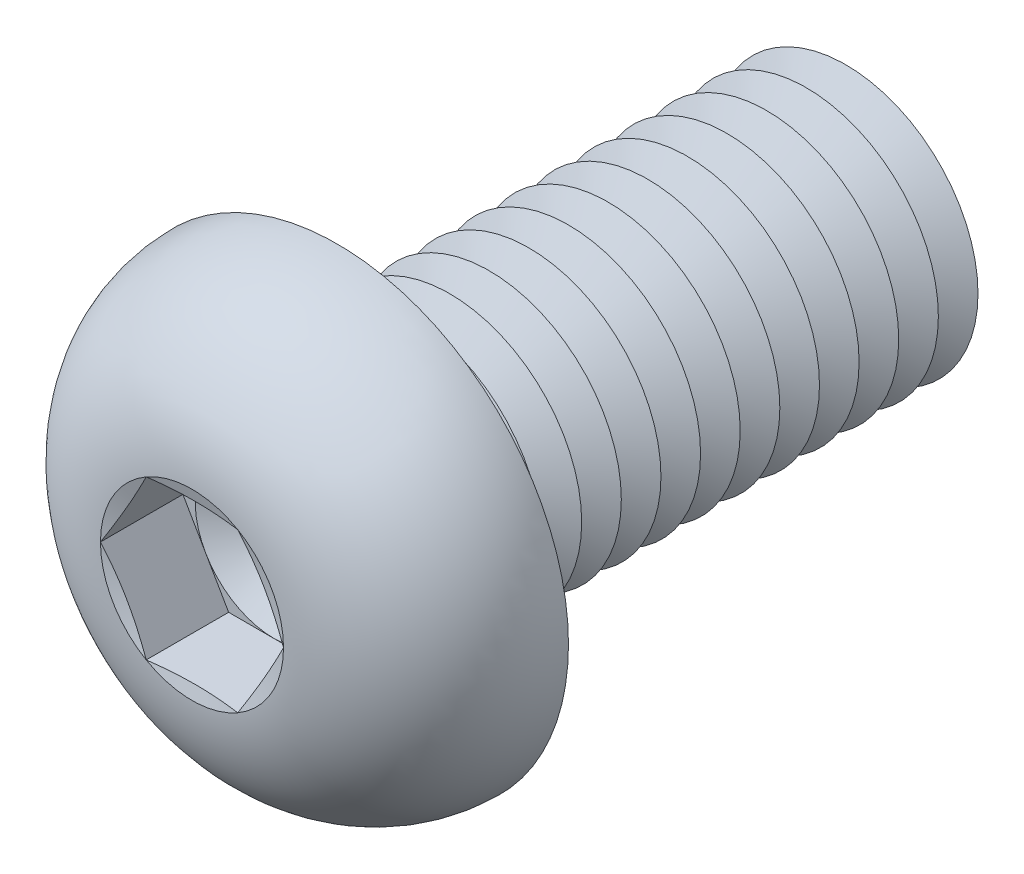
ISO-10303-21;
HEADER;
FILE_DESCRIPTION(('STEP AP214'),'2;1');
FILE_NAME('part.step','',(''),(''),'','','');
FILE_SCHEMA(('AUTOMOTIVE_DESIGN { 1 0 10303 214 1 1 1 1 }'));
ENDSEC;
DATA;
#1=APPLICATION_CONTEXT('core data for automotive mechanical design processes');
#2=APPLICATION_PROTOCOL_DEFINITION('international standard','automotive_design',2000,#1);
#3=PRODUCT_CONTEXT('',#1,'mechanical');
#4=PRODUCT('Part','Part','',(#3));
#5=PRODUCT_RELATED_PRODUCT_CATEGORY('part','',(#4));
#6=PRODUCT_DEFINITION_FORMATION('','',#4);
#7=PRODUCT_DEFINITION_CONTEXT('part definition',#1,'design');
#8=PRODUCT_DEFINITION('design','',#6,#7);
#9=PRODUCT_DEFINITION_SHAPE('','',#8);
#10=(LENGTH_UNIT() NAMED_UNIT(*) SI_UNIT(.MILLI.,.METRE.));
#11=(NAMED_UNIT(*) PLANE_ANGLE_UNIT() SI_UNIT($,.RADIAN.));
#12=(NAMED_UNIT(*) SI_UNIT($,.STERADIAN.) SOLID_ANGLE_UNIT());
#13=UNCERTAINTY_MEASURE_WITH_UNIT(LENGTH_MEASURE(1.E-05),#10,'distance_accuracy_value','');
#14=(GEOMETRIC_REPRESENTATION_CONTEXT(3) GLOBAL_UNCERTAINTY_ASSIGNED_CONTEXT((#13)) GLOBAL_UNIT_ASSIGNED_CONTEXT((#10,
#11,#12)) REPRESENTATION_CONTEXT('',''));
#15=CARTESIAN_POINT('',(0.,0.,0.));
#16=DIRECTION('',(0.,0.,1.));
#17=DIRECTION('',(1.,0.,0.));
#18=AXIS2_PLACEMENT_3D('',#15,#16,#17);
#19=CARTESIAN_POINT('',(0.,0.,2.38));
#20=DIRECTION('',(0.,0.,1.));
#21=DIRECTION('',(1.,0.,0.));
#22=AXIS2_PLACEMENT_3D('',#19,#20,#21);
#23=PLANE('',#22);
#24=CARTESIAN_POINT('',(0.,0.,2.38));
#25=DIRECTION('',(0.,0.,1.));
#26=DIRECTION('',(1.,0.,0.));
#27=AXIS2_PLACEMENT_3D('',#24,#25,#26);
#28=CIRCLE('',#27,2.99999860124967);
#29=CARTESIAN_POINT('',(2.598075,1.49999930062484,2.38));
#30=VERTEX_POINT('',#29);
#31=CARTESIAN_POINT('',(0.,2.99999860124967,2.38));
#32=VERTEX_POINT('',#31);
#33=EDGE_CURVE('E118',#30,#32,#28,.T.);
#34=ORIENTED_EDGE('',*,*,#33,.F.);
#35=DIRECTION('',(-0.500000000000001,0.866025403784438,0.));
#36=VECTOR('',#35,1.);
#37=CARTESIAN_POINT('',(3.4641,0.,2.38));
#38=LINE('',#37,#36);
#39=CARTESIAN_POINT('',(1.73205,2.99999860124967,2.38));
#40=VERTEX_POINT('',#39);
#41=EDGE_CURVE('E125',#30,#40,#38,.T.);
#42=ORIENTED_EDGE('',*,*,#41,.T.);
#43=DIRECTION('',(-1.,0.,0.));
#44=VECTOR('',#43,1.);
#45=CARTESIAN_POINT('',(1.73205,2.99999860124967,2.38));
#46=LINE('',#45,#44);
#47=EDGE_CURVE('E136',#40,#32,#46,.T.);
#48=ORIENTED_EDGE('',*,*,#47,.T.);
#49=EDGE_LOOP('',(#34,#42,#48));
#50=FACE_BOUND('',#49,.T.);
#51=ADVANCED_FACE('F39',(#50),#23,.T.);
#52=CARTESIAN_POINT('',(0.,0.,2.38));
#53=DIRECTION('',(0.,0.,1.));
#54=DIRECTION('',(1.,0.,0.));
#55=AXIS2_PLACEMENT_3D('',#52,#53,#54);
#56=CIRCLE('',#55,2.99999860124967);
#57=CARTESIAN_POINT('',(-2.598075,1.49999930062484,2.38));
#58=VERTEX_POINT('',#57);
#59=EDGE_CURVE('E11',#32,#58,#56,.T.);
#60=ORIENTED_EDGE('',*,*,#59,.F.);
#61=CARTESIAN_POINT('',(-1.73205,2.99999860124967,2.38));
#62=VERTEX_POINT('',#61);
#63=EDGE_CURVE('E131',#32,#62,#46,.T.);
#64=ORIENTED_EDGE('',*,*,#63,.T.);
#65=DIRECTION('',(-0.5,-0.866025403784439,0.));
#66=VECTOR('',#65,1.);
#67=CARTESIAN_POINT('',(-1.73205,2.99999860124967,2.38));
#68=LINE('',#67,#66);
#69=EDGE_CURVE('E134',#62,#58,#68,.T.);
#70=ORIENTED_EDGE('',*,*,#69,.T.);
#71=EDGE_LOOP('',(#60,#64,#70));
#72=FACE_BOUND('',#71,.T.);
#73=ADVANCED_FACE('F130',(#72),#23,.T.);
#74=CARTESIAN_POINT('',(-2.598075,-1.49999930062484,2.38));
#75=VERTEX_POINT('',#74);
#76=EDGE_CURVE('E49',#58,#75,#56,.T.);
#77=ORIENTED_EDGE('',*,*,#76,.F.);
#78=CARTESIAN_POINT('',(-3.4641,0.,2.38));
#79=VERTEX_POINT('',#78);
#80=EDGE_CURVE('E143',#58,#79,#68,.T.);
#81=ORIENTED_EDGE('',*,*,#80,.T.);
#82=DIRECTION('',(0.5,-0.866025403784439,0.));
#83=VECTOR('',#82,1.);
#84=CARTESIAN_POINT('',(-3.4641,0.,2.38));
#85=LINE('',#84,#83);
#86=EDGE_CURVE('E152',#79,#75,#85,.T.);
#87=ORIENTED_EDGE('',*,*,#86,.T.);
#88=EDGE_LOOP('',(#77,#81,#87));
#89=FACE_BOUND('',#88,.T.);
#90=ADVANCED_FACE('F500',(#89),#23,.T.);
#91=CARTESIAN_POINT('',(0.,-2.99999860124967,2.38));
#92=VERTEX_POINT('',#91);
#93=EDGE_CURVE('E463',#75,#92,#56,.T.);
#94=ORIENTED_EDGE('',*,*,#93,.F.);
#95=CARTESIAN_POINT('',(-1.73205,-2.99999860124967,2.38));
#96=VERTEX_POINT('',#95);
#97=EDGE_CURVE('E151',#75,#96,#85,.T.);
#98=ORIENTED_EDGE('',*,*,#97,.T.);
#99=DIRECTION('',(1.,0.,0.));
#100=VECTOR('',#99,1.);
#101=CARTESIAN_POINT('',(-1.73205,-2.99999860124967,2.38));
#102=LINE('',#101,#100);
#103=EDGE_CURVE('E157',#96,#92,#102,.T.);
#104=ORIENTED_EDGE('',*,*,#103,.T.);
#105=EDGE_LOOP('',(#94,#98,#104));
#106=FACE_BOUND('',#105,.T.);
#107=ADVANCED_FACE('F505',(#106),#23,.T.);
#108=CARTESIAN_POINT('',(2.598075,-1.49999930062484,2.38));
#109=VERTEX_POINT('',#108);
#110=EDGE_CURVE('E56',#92,#109,#56,.T.);
#111=ORIENTED_EDGE('',*,*,#110,.F.);
#112=CARTESIAN_POINT('',(1.73205,-2.99999860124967,2.38));
#113=VERTEX_POINT('',#112);
#114=EDGE_CURVE('E156',#92,#113,#102,.T.);
#115=ORIENTED_EDGE('',*,*,#114,.T.);
#116=DIRECTION('',(0.5,0.866025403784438,0.));
#117=VECTOR('',#116,1.);
#118=CARTESIAN_POINT('',(1.73205,-2.99999860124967,2.38));
#119=LINE('',#118,#117);
#120=EDGE_CURVE('E162',#113,#109,#119,.T.);
#121=ORIENTED_EDGE('',*,*,#120,.T.);
#122=EDGE_LOOP('',(#111,#115,#121));
#123=FACE_BOUND('',#122,.T.);
#124=ADVANCED_FACE('F358',(#123),#23,.T.);
#125=CARTESIAN_POINT('',(0.,0.,5.5));
#126=DIRECTION('',(0.,0.,1.));
#127=DIRECTION('',(1.,0.,0.));
#128=AXIS2_PLACEMENT_3D('',#125,#126,#127);
#129=CONICAL_SURFACE('',#128,3.4641,1.30899693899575);
#130=CARTESIAN_POINT('',(3.46421547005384,-0.000199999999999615,5.50003094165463));
#131=CARTESIAN_POINT('',(3.39227822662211,0.124398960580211,5.48074619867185));
#132=CARTESIAN_POINT('',(3.32021054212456,0.24922385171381,5.46323875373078));
#133=CARTESIAN_POINT('',(3.17582062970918,0.49931451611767,5.43247971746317));
#134=CARTESIAN_POINT('',(3.10349831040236,0.62458044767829,5.41922985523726));
#135=CARTESIAN_POINT('',(2.95903767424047,0.874793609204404,5.39775958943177));
#136=CARTESIAN_POINT('',(2.88690033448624,0.999739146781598,5.38951357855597));
#137=CARTESIAN_POINT('',(2.74253364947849,1.24978958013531,5.37845651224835));
#138=CARTESIAN_POINT('',(2.67030432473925,1.37489444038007,5.3756444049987));
#139=CARTESIAN_POINT('',(2.52584567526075,1.6251041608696,5.3756444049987));
#140=CARTESIAN_POINT('',(2.45361635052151,1.75020902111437,5.37845651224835));
#141=CARTESIAN_POINT('',(2.30924966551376,2.00025945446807,5.38951357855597));
#142=CARTESIAN_POINT('',(2.23711232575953,2.12520499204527,5.39775958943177));
#143=CARTESIAN_POINT('',(2.09265168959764,2.37541815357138,5.41922985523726));
#144=CARTESIAN_POINT('',(2.02032937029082,2.500684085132,5.43247971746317));
#145=CARTESIAN_POINT('',(1.87593945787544,2.75077474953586,5.46323875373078));
#146=CARTESIAN_POINT('',(1.80387177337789,2.87559964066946,5.48074619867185));
#147=CARTESIAN_POINT('',(1.73193452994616,3.00019860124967,5.50003094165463));
#148=B_SPLINE_CURVE_WITH_KNOTS('',3,(#130,#131,#132,#133,#134,#135,#136,#137,#138,#139,#140,
#141,#142,#143,#144,#145,#146,#147),.UNSPECIFIED.,.F.,.F.,(4,2,2,2,2,2,2,2,4),(0.,
0.435506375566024,0.871189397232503,1.3046235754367,1.7379738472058,2.1713241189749,
2.6047582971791,3.04044131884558,3.4759476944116),.UNSPECIFIED.);
#149=CARTESIAN_POINT('',(3.4641,0.,5.5));
#150=VERTEX_POINT('',#149);
#151=CARTESIAN_POINT('',(1.73204999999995,2.9999986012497,5.5));
#152=VERTEX_POINT('',#151);
#153=EDGE_CURVE('E229',#150,#152,#148,.T.);
#154=ORIENTED_EDGE('',*,*,#153,.F.);
#155=CARTESIAN_POINT('',(0.,0.,5.5));
#156=DIRECTION('',(0.,0.,-1.));
#157=DIRECTION('',(-1.,0.,0.));
#158=AXIS2_PLACEMENT_3D('',#155,#156,#157);
#159=CIRCLE('',#158,3.4641);
#160=EDGE_CURVE('E310',#152,#150,#159,.T.);
#161=ORIENTED_EDGE('',*,*,#160,.F.);
#162=EDGE_LOOP('',(#154,#161));
#163=FACE_BOUND('',#162,.T.);
#164=ADVANCED_FACE('F352',(#163),#129,.F.);
#165=CARTESIAN_POINT('',(1.73193452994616,-3.00019860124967,5.50003094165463));
#166=CARTESIAN_POINT('',(1.80387177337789,-2.87559964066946,5.48074619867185));
#167=CARTESIAN_POINT('',(1.87593945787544,-2.75077474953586,5.46323875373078));
#168=CARTESIAN_POINT('',(2.02032937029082,-2.500684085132,5.43247971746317));
#169=CARTESIAN_POINT('',(2.09265168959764,-2.37541815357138,5.41922985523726));
#170=CARTESIAN_POINT('',(2.23711232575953,-2.12520499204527,5.39775958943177));
#171=CARTESIAN_POINT('',(2.30924966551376,-2.00025945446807,5.38951357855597));
#172=CARTESIAN_POINT('',(2.45361635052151,-1.75020902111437,5.37845651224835));
#173=CARTESIAN_POINT('',(2.52584567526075,-1.6251041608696,5.3756444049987));
#174=CARTESIAN_POINT('',(2.67030432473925,-1.37489444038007,5.3756444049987));
#175=CARTESIAN_POINT('',(2.74253364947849,-1.24978958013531,5.37845651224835));
#176=CARTESIAN_POINT('',(2.88690033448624,-0.999739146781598,5.38951357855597));
#177=CARTESIAN_POINT('',(2.95903767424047,-0.874793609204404,5.39775958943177));
#178=CARTESIAN_POINT('',(3.10349831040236,-0.624580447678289,5.41922985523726));
#179=CARTESIAN_POINT('',(3.17582062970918,-0.499314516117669,5.43247971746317));
#180=CARTESIAN_POINT('',(3.32021054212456,-0.249223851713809,5.46323875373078));
#181=CARTESIAN_POINT('',(3.39227822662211,-0.124398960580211,5.48074619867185));
#182=CARTESIAN_POINT('',(3.46421547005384,0.000200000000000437,5.50003094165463));
#183=B_SPLINE_CURVE_WITH_KNOTS('',3,(#165,#166,#167,#168,#169,#170,#171,#172,#173,#174,#175,
#176,#177,#178,#179,#180,#181,#182),.UNSPECIFIED.,.F.,.F.,(4,2,2,2,2,2,2,2,4),(0.,
0.435506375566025,0.871189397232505,1.3046235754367,1.7379738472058,2.1713241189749,
2.6047582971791,3.04044131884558,3.4759476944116),.UNSPECIFIED.);
#184=CARTESIAN_POINT('',(1.73205,-2.99999860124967,5.5));
#185=VERTEX_POINT('',#184);
#186=EDGE_CURVE('E232',#185,#150,#183,.T.);
#187=ORIENTED_EDGE('',*,*,#186,.F.);
#188=EDGE_CURVE('E292',#150,#185,#159,.T.);
#189=ORIENTED_EDGE('',*,*,#188,.F.);
#190=EDGE_LOOP('',(#187,#189));
#191=FACE_BOUND('',#190,.T.);
#192=ADVANCED_FACE('F290',(#191),#129,.F.);
#193=CARTESIAN_POINT('',(-5.2273006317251,-2.99999860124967,6.18672552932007));
#194=CARTESIAN_POINT('',(-5.10075887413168,-2.99999860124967,6.15732018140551));
#195=CARTESIAN_POINT('',(-4.97415993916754,-2.99999860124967,6.12816064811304));
#196=CARTESIAN_POINT('',(-4.72082394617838,-2.99999860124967,6.07043857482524));
#197=CARTESIAN_POINT('',(-4.59408688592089,-2.99999860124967,6.04187604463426));
#198=CARTESIAN_POINT('',(-4.21358997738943,-2.99999860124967,5.95723252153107));
#199=CARTESIAN_POINT('',(-3.95959339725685,-2.99999860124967,5.90220706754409));
#200=CARTESIAN_POINT('',(-3.44835573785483,-2.99999860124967,5.79574115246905));
#201=CARTESIAN_POINT('',(-3.19110656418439,-2.99999860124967,5.74433913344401));
#202=CARTESIAN_POINT('',(-2.67540790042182,-2.99999860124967,5.6477299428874));
#203=CARTESIAN_POINT('',(-2.41695830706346,-2.99999860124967,5.60252331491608));
#204=CARTESIAN_POINT('',(-1.9055512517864,-2.99999860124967,5.52251897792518));
#205=CARTESIAN_POINT('',(-1.65263426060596,-2.99999860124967,5.48747285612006));
#206=CARTESIAN_POINT('',(-1.27220564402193,-2.99999860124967,5.44439602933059));
#207=CARTESIAN_POINT('',(-1.1452320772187,-2.99999860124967,5.43161987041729));
#208=CARTESIAN_POINT('',(-0.890973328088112,-2.99999860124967,5.40972605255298));
#209=CARTESIAN_POINT('',(-0.76368816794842,-2.99999860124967,5.40060814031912));
#210=CARTESIAN_POINT('',(-0.50944206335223,-2.99999860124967,5.38647457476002));
#211=CARTESIAN_POINT('',(-0.382482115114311,-2.99999860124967,5.38144125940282));
#212=CARTESIAN_POINT('',(-0.128463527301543,-2.99999860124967,5.37566637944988));
#213=CARTESIAN_POINT('',(-0.00140488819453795,-2.99999860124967,5.37492479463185));
#214=CARTESIAN_POINT('',(0.252672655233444,-2.99999860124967,5.37777315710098));
#215=CARTESIAN_POINT('',(0.379691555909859,-2.99999860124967,5.38136342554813));
#216=CARTESIAN_POINT('',(0.633540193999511,-2.99999860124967,5.39268816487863));
#217=CARTESIAN_POINT('',(0.760369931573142,-2.99999860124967,5.40042263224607));
#218=CARTESIAN_POINT('',(1.06836981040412,-2.99999860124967,5.42382465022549));
#219=CARTESIAN_POINT('',(1.24938929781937,-2.99999860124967,5.44147485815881));
#220=CARTESIAN_POINT('',(1.61066786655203,-2.99999860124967,5.48312309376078));
#221=CARTESIAN_POINT('',(1.7909269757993,-2.99999860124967,5.50712088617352));
#222=CARTESIAN_POINT('',(2.15127612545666,-2.99999860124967,5.56013471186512));
#223=CARTESIAN_POINT('',(2.33136383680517,-2.99999860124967,5.58916634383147));
#224=CARTESIAN_POINT('',(2.690892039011,-2.99999860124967,5.65100028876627));
#225=CARTESIAN_POINT('',(2.87033249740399,-2.99999860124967,5.68380278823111));
#226=CARTESIAN_POINT('',(3.23235399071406,-2.99999860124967,5.75295369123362));
#227=CARTESIAN_POINT('',(3.4149236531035,-2.99999860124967,5.78936117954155));
#228=CARTESIAN_POINT('',(3.77960351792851,-2.99999860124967,5.864406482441));
#229=CARTESIAN_POINT('',(3.96171371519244,-2.99999860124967,5.903044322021));
#230=CARTESIAN_POINT('',(4.32457472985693,-2.99999860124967,5.9817966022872));
#231=CARTESIAN_POINT('',(4.5053275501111,-2.99999860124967,6.02190185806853));
#232=CARTESIAN_POINT('',(4.86652484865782,-2.99999860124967,6.10342152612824));
#233=CARTESIAN_POINT('',(5.04696934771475,-2.99999860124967,6.14483584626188));
#234=CARTESIAN_POINT('',(5.2273006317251,-2.99999860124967,6.18672552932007));
#235=B_SPLINE_CURVE_WITH_KNOTS('',3,(#193,#194,#195,#196,#197,#198,#199,#200,#201,#202,#203,
#204,#205,#206,#207,#208,#209,#210,#211,#212,#213,#214,#215,#216,#217,#218,#219,#220,#221,#222,
#223,#224,#225,#226,#227,#228,#229,#230,#231,#232,#233,#234),.UNSPECIFIED.,.F.,.F.,(4,2,2,2,2,2,
2,2,2,2,2,2,2,2,2,2,2,2,2,2,4),(0.,0.389739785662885,0.779485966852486,1.5591292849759,
2.34608117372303,3.13310206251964,3.8988410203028,4.28164148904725,4.66441544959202,
5.04552531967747,5.42663339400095,5.80776972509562,6.18890573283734,6.73438998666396,
7.27985402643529,7.8270395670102,8.37425218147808,8.93272720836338,9.49120849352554,
10.0466490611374,10.6020506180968),.UNSPECIFIED.);
#236=CARTESIAN_POINT('',(-1.73205,-2.99999860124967,5.5));
#237=VERTEX_POINT('',#236);
#238=EDGE_CURVE('E242',#237,#185,#235,.T.);
#239=ORIENTED_EDGE('',*,*,#238,.F.);
#240=EDGE_CURVE('E297',#185,#237,#159,.T.);
#241=ORIENTED_EDGE('',*,*,#240,.F.);
#242=EDGE_LOOP('',(#239,#241));
#243=FACE_BOUND('',#242,.T.);
#244=ADVANCED_FACE('F298',(#243),#129,.F.);
#245=CARTESIAN_POINT('',(-3.46421547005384,0.000200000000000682,5.50003094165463));
#246=CARTESIAN_POINT('',(-3.39227822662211,-0.12439896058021,5.48074619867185));
#247=CARTESIAN_POINT('',(-3.32021054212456,-0.249223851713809,5.46323875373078));
#248=CARTESIAN_POINT('',(-3.17582062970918,-0.499314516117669,5.43247971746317));
#249=CARTESIAN_POINT('',(-3.10349831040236,-0.624580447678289,5.41922985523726));
#250=CARTESIAN_POINT('',(-2.95903767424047,-0.874793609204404,5.39775958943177));
#251=CARTESIAN_POINT('',(-2.88690033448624,-0.999739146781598,5.38951357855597));
#252=CARTESIAN_POINT('',(-2.74253364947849,-1.24978958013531,5.37845651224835));
#253=CARTESIAN_POINT('',(-2.67030432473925,-1.37489444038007,5.3756444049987));
#254=CARTESIAN_POINT('',(-2.52584567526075,-1.6251041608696,5.3756444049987));
#255=CARTESIAN_POINT('',(-2.45361635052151,-1.75020902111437,5.37845651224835));
#256=CARTESIAN_POINT('',(-2.30924966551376,-2.00025945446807,5.38951357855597));
#257=CARTESIAN_POINT('',(-2.23711232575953,-2.12520499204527,5.39775958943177));
#258=CARTESIAN_POINT('',(-2.09265168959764,-2.37541815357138,5.41922985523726));
#259=CARTESIAN_POINT('',(-2.02032937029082,-2.500684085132,5.43247971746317));
#260=CARTESIAN_POINT('',(-1.87593945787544,-2.75077474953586,5.46323875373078));
#261=CARTESIAN_POINT('',(-1.80387177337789,-2.87559964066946,5.48074619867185));
#262=CARTESIAN_POINT('',(-1.73193452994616,-3.00019860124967,5.50003094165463));
#263=B_SPLINE_CURVE_WITH_KNOTS('',3,(#245,#246,#247,#248,#249,#250,#251,#252,#253,#254,#255,
#256,#257,#258,#259,#260,#261,#262),.UNSPECIFIED.,.F.,.F.,(4,2,2,2,2,2,2,2,4),(0.,
0.435506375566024,0.871189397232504,1.3046235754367,1.7379738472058,2.1713241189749,
2.6047582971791,3.04044131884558,3.4759476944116),.UNSPECIFIED.);
#264=CARTESIAN_POINT('',(-3.4641,0.,5.5));
#265=VERTEX_POINT('',#264);
#266=EDGE_CURVE('E237',#265,#237,#263,.T.);
#267=ORIENTED_EDGE('',*,*,#266,.F.);
#268=EDGE_CURVE('E303',#237,#265,#159,.T.);
#269=ORIENTED_EDGE('',*,*,#268,.F.);
#270=EDGE_LOOP('',(#267,#269));
#271=FACE_BOUND('',#270,.T.);
#272=ADVANCED_FACE('F524',(#271),#129,.F.);
#273=CARTESIAN_POINT('',(-1.73193452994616,3.00019860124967,5.50003094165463));
#274=CARTESIAN_POINT('',(-1.8038717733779,2.87559964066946,5.48074619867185));
#275=CARTESIAN_POINT('',(-1.87593945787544,2.75077474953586,5.46323875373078));
#276=CARTESIAN_POINT('',(-2.02032937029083,2.500684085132,5.43247971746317));
#277=CARTESIAN_POINT('',(-2.09265168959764,2.37541815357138,5.41922985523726));
#278=CARTESIAN_POINT('',(-2.23711232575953,2.12520499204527,5.39775958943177));
#279=CARTESIAN_POINT('',(-2.30924966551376,2.00025945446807,5.38951357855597));
#280=CARTESIAN_POINT('',(-2.45361635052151,1.75020902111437,5.37845651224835));
#281=CARTESIAN_POINT('',(-2.52584567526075,1.6251041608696,5.3756444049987));
#282=CARTESIAN_POINT('',(-2.67030432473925,1.37489444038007,5.3756444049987));
#283=CARTESIAN_POINT('',(-2.74253364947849,1.24978958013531,5.37845651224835));
#284=CARTESIAN_POINT('',(-2.88690033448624,0.999739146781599,5.38951357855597));
#285=CARTESIAN_POINT('',(-2.95903767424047,0.874793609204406,5.39775958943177));
#286=CARTESIAN_POINT('',(-3.10349831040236,0.624580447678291,5.41922985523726));
#287=CARTESIAN_POINT('',(-3.17582062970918,0.499314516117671,5.43247971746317));
#288=CARTESIAN_POINT('',(-3.32021054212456,0.249223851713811,5.46323875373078));
#289=CARTESIAN_POINT('',(-3.39227822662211,0.124398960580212,5.48074619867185));
#290=CARTESIAN_POINT('',(-3.46421547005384,-0.000199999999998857,5.50003094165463));
#291=B_SPLINE_CURVE_WITH_KNOTS('',3,(#273,#274,#275,#276,#277,#278,#279,#280,#281,#282,#283,
#284,#285,#286,#287,#288,#289,#290),.UNSPECIFIED.,.F.,.F.,(4,2,2,2,2,2,2,2,4),(0.,
0.435506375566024,0.871189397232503,1.3046235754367,1.7379738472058,2.1713241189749,
2.6047582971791,3.04044131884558,3.4759476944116),.UNSPECIFIED.);
#292=CARTESIAN_POINT('',(-1.73205,2.99999860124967,5.5));
#293=VERTEX_POINT('',#292);
#294=EDGE_CURVE('E234',#293,#265,#291,.T.);
#295=ORIENTED_EDGE('',*,*,#294,.F.);
#296=EDGE_CURVE('E334',#265,#293,#159,.T.);
#297=ORIENTED_EDGE('',*,*,#296,.F.);
#298=EDGE_LOOP('',(#295,#297));
#299=FACE_BOUND('',#298,.T.);
#300=ADVANCED_FACE('F527',(#299),#129,.F.);
#301=CARTESIAN_POINT('',(0.,0.,-14.75));
#302=DIRECTION('',(0.,0.,1.));
#303=DIRECTION('',(1.,0.,0.));
#304=AXIS2_PLACEMENT_3D('',#301,#302,#303);
#305=CONICAL_SURFACE('',#304,5.00000000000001,1.0471975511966);
#306=CARTESIAN_POINT('',(0.,0.,-15.5));
#307=DIRECTION('',(0.,0.,1.));
#308=DIRECTION('',(1.,0.,0.));
#309=AXIS2_PLACEMENT_3D('',#306,#307,#308);
#310=CIRCLE('',#309,3.70096189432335);
#311=CARTESIAN_POINT('',(3.70096189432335,0.,-15.5));
#312=VERTEX_POINT('',#311);
#313=EDGE_CURVE('E432',#312,#312,#310,.T.);
#314=ORIENTED_EDGE('',*,*,#313,.T.);
#315=EDGE_LOOP('',(#314));
#316=FACE_BOUND('',#315,.T.);
#317=CARTESIAN_POINT('',(0.,0.,-14.75));
#318=DIRECTION('',(0.,0.,1.));
#319=DIRECTION('',(1.,0.,0.));
#320=AXIS2_PLACEMENT_3D('',#317,#318,#319);
#321=CIRCLE('',#320,5.00000000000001);
#322=CARTESIAN_POINT('',(5.00000000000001,0.,-14.75));
#323=VERTEX_POINT('',#322);
#324=EDGE_CURVE('E429',#323,#323,#321,.T.);
#325=ORIENTED_EDGE('',*,*,#324,.F.);
#326=EDGE_LOOP('',(#325));
#327=FACE_BOUND('',#326,.T.);
#328=ADVANCED_FACE('F532',(#316,#327),#305,.T.);
#329=CARTESIAN_POINT('',(0.,0.,-15.5));
#330=DIRECTION('',(0.,0.,-1.));
#331=DIRECTION('',(-1.,0.,0.));
#332=AXIS2_PLACEMENT_3D('',#329,#330,#331);
#333=CONICAL_SURFACE('',#332,3.70096189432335,1.0471975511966);
#334=CARTESIAN_POINT('',(0.,0.,-16.25));
#335=DIRECTION('',(0.,0.,1.));
#336=DIRECTION('',(1.,0.,0.));
#337=AXIS2_PLACEMENT_3D('',#334,#335,#336);
#338=CIRCLE('',#337,5.00000000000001);
#339=CARTESIAN_POINT('',(5.00000000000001,0.,-16.25));
#340=VERTEX_POINT('',#339);
#341=EDGE_CURVE('E436',#340,#340,#338,.T.);
#342=ORIENTED_EDGE('',*,*,#341,.T.);
#343=EDGE_LOOP('',(#342));
#344=FACE_BOUND('',#343,.T.);
#345=ORIENTED_EDGE('',*,*,#313,.F.);
#346=EDGE_LOOP('',(#345));
#347=FACE_BOUND('',#346,.T.);
#348=ADVANCED_FACE('F882',(#344,#347),#333,.T.);
#349=CARTESIAN_POINT('',(0.,5.00000000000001,-20.));
#350=DIRECTION('',(0.,0.,-1.));
#351=DIRECTION('',(-1.,0.,0.));
#352=AXIS2_PLACEMENT_3D('',#349,#350,#351);
#353=PLANE('',#352);
#354=CARTESIAN_POINT('',(0.,0.,-20.));
#355=DIRECTION('',(0.,0.,1.));
#356=DIRECTION('',(1.,0.,0.));
#357=AXIS2_PLACEMENT_3D('',#354,#355,#356);
#358=CIRCLE('',#357,3.70096189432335);
#359=CARTESIAN_POINT('',(3.70096189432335,0.,-20.));
#360=VERTEX_POINT('',#359);
#361=EDGE_CURVE('E324',#360,#360,#358,.T.);
#362=ORIENTED_EDGE('',*,*,#361,.F.);
#363=EDGE_LOOP('',(#362));
#364=FACE_BOUND('',#363,.T.);
#365=ADVANCED_FACE('F874',(#364),#353,.T.);
#366=CARTESIAN_POINT('',(0.,0.,-19.25));
#367=DIRECTION('',(0.,0.,1.));
#368=DIRECTION('',(1.,0.,0.));
#369=AXIS2_PLACEMENT_3D('',#366,#367,#368);
#370=CONICAL_SURFACE('',#369,5.00000000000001,1.0471975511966);
#371=ORIENTED_EDGE('',*,*,#361,.T.);
#372=EDGE_LOOP('',(#371));
#373=FACE_BOUND('',#372,.T.);
#374=CARTESIAN_POINT('',(0.,0.,-19.25));
#375=DIRECTION('',(0.,0.,1.));
#376=DIRECTION('',(1.,0.,0.));
#377=AXIS2_PLACEMENT_3D('',#374,#375,#376);
#378=CIRCLE('',#377,5.00000000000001);
#379=CARTESIAN_POINT('',(5.00000000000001,0.,-19.25));
#380=VERTEX_POINT('',#379);
#381=EDGE_CURVE('E450',#380,#380,#378,.T.);
#382=ORIENTED_EDGE('',*,*,#381,.F.);
#383=EDGE_LOOP('',(#382));
#384=FACE_BOUND('',#383,.T.);
#385=ADVANCED_FACE('F866',(#373,#384),#370,.T.);
#386=CARTESIAN_POINT('',(0.,0.,-18.5));
#387=DIRECTION('',(0.,0.,-1.));
#388=DIRECTION('',(-1.,0.,0.));
#389=AXIS2_PLACEMENT_3D('',#386,#387,#388);
#390=CONICAL_SURFACE('',#389,3.70096189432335,1.0471975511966);
#391=ORIENTED_EDGE('',*,*,#381,.T.);
#392=EDGE_LOOP('',(#391));
#393=FACE_BOUND('',#392,.T.);
#394=CARTESIAN_POINT('',(0.,0.,-18.5));
#395=DIRECTION('',(0.,0.,1.));
#396=DIRECTION('',(1.,0.,0.));
#397=AXIS2_PLACEMENT_3D('',#394,#395,#396);
#398=CIRCLE('',#397,3.70096189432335);
#399=CARTESIAN_POINT('',(3.70096189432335,0.,-18.5));
#400=VERTEX_POINT('',#399);
#401=EDGE_CURVE('E447',#400,#400,#398,.T.);
#402=ORIENTED_EDGE('',*,*,#401,.F.);
#403=EDGE_LOOP('',(#402));
#404=FACE_BOUND('',#403,.T.);
#405=ADVANCED_FACE('F857',(#393,#404),#390,.T.);
#406=CARTESIAN_POINT('',(0.,0.,-17.75));
#407=DIRECTION('',(0.,0.,1.));
#408=DIRECTION('',(1.,0.,0.));
#409=AXIS2_PLACEMENT_3D('',#406,#407,#408);
#410=CONICAL_SURFACE('',#409,5.00000000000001,1.0471975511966);
#411=ORIENTED_EDGE('',*,*,#401,.T.);
#412=EDGE_LOOP('',(#411));
#413=FACE_BOUND('',#412,.T.);
#414=CARTESIAN_POINT('',(0.,0.,-17.75));
#415=DIRECTION('',(0.,0.,1.));
#416=DIRECTION('',(1.,0.,0.));
#417=AXIS2_PLACEMENT_3D('',#414,#415,#416);
#418=CIRCLE('',#417,5.00000000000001);
#419=CARTESIAN_POINT('',(5.00000000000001,0.,-17.75));
#420=VERTEX_POINT('',#419);
#421=EDGE_CURVE('E443',#420,#420,#418,.T.);
#422=ORIENTED_EDGE('',*,*,#421,.F.);
#423=EDGE_LOOP('',(#422));
#424=FACE_BOUND('',#423,.T.);
#425=ADVANCED_FACE('F848',(#413,#424),#410,.T.);
#426=CARTESIAN_POINT('',(0.,0.,-17.));
#427=DIRECTION('',(0.,0.,-1.));
#428=DIRECTION('',(-1.,0.,0.));
#429=AXIS2_PLACEMENT_3D('',#426,#427,#428);
#430=CONICAL_SURFACE('',#429,3.70096189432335,1.0471975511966);
#431=ORIENTED_EDGE('',*,*,#421,.T.);
#432=EDGE_LOOP('',(#431));
#433=FACE_BOUND('',#432,.T.);
#434=CARTESIAN_POINT('',(0.,0.,-17.));
#435=DIRECTION('',(0.,0.,1.));
#436=DIRECTION('',(1.,0.,0.));
#437=AXIS2_PLACEMENT_3D('',#434,#435,#436);
#438=CIRCLE('',#437,3.70096189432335);
#439=CARTESIAN_POINT('',(3.70096189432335,0.,-17.));
#440=VERTEX_POINT('',#439);
#441=EDGE_CURVE('E440',#440,#440,#438,.T.);
#442=ORIENTED_EDGE('',*,*,#441,.F.);
#443=EDGE_LOOP('',(#442));
#444=FACE_BOUND('',#443,.T.);
#445=ADVANCED_FACE('F839',(#433,#444),#430,.T.);
#446=CARTESIAN_POINT('',(0.,0.,-16.25));
#447=DIRECTION('',(0.,0.,1.));
#448=DIRECTION('',(1.,0.,0.));
#449=AXIS2_PLACEMENT_3D('',#446,#447,#448);
#450=CONICAL_SURFACE('',#449,5.00000000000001,1.0471975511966);
#451=ORIENTED_EDGE('',*,*,#441,.T.);
#452=EDGE_LOOP('',(#451));
#453=FACE_BOUND('',#452,.T.);
#454=ORIENTED_EDGE('',*,*,#341,.F.);
#455=EDGE_LOOP('',(#454));
#456=FACE_BOUND('',#455,.T.);
#457=ADVANCED_FACE('F830',(#453,#456),#450,.T.);
#458=CARTESIAN_POINT('',(0.,0.,-13.25));
#459=DIRECTION('',(0.,0.,1.));
#460=DIRECTION('',(1.,0.,0.));
#461=AXIS2_PLACEMENT_3D('',#458,#459,#460);
#462=CONICAL_SURFACE('',#461,5.00000000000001,1.0471975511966);
#463=CARTESIAN_POINT('',(0.,0.,-14.));
#464=DIRECTION('',(0.,0.,1.));
#465=DIRECTION('',(1.,0.,0.));
#466=AXIS2_PLACEMENT_3D('',#463,#464,#465);
#467=CIRCLE('',#466,3.70096189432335);
#468=CARTESIAN_POINT('',(3.70096189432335,0.,-14.));
#469=VERTEX_POINT('',#468);
#470=EDGE_CURVE('E426',#469,#469,#467,.T.);
#471=ORIENTED_EDGE('',*,*,#470,.T.);
#472=EDGE_LOOP('',(#471));
#473=FACE_BOUND('',#472,.T.);
#474=CARTESIAN_POINT('',(0.,0.,-13.25));
#475=DIRECTION('',(0.,0.,1.));
#476=DIRECTION('',(1.,0.,0.));
#477=AXIS2_PLACEMENT_3D('',#474,#475,#476);
#478=CIRCLE('',#477,5.00000000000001);
#479=CARTESIAN_POINT('',(5.00000000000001,0.,-13.25));
#480=VERTEX_POINT('',#479);
#481=EDGE_CURVE('E422',#480,#480,#478,.T.);
#482=ORIENTED_EDGE('',*,*,#481,.F.);
#483=EDGE_LOOP('',(#482));
#484=FACE_BOUND('',#483,.T.);
#485=ADVANCED_FACE('F821',(#473,#484),#462,.T.);
#486=CARTESIAN_POINT('',(0.,0.,-14.));
#487=DIRECTION('',(0.,0.,-1.));
#488=DIRECTION('',(-1.,0.,0.));
#489=AXIS2_PLACEMENT_3D('',#486,#487,#488);
#490=CONICAL_SURFACE('',#489,3.70096189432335,1.0471975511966);
#491=ORIENTED_EDGE('',*,*,#324,.T.);
#492=EDGE_LOOP('',(#491));
#493=FACE_BOUND('',#492,.T.);
#494=ORIENTED_EDGE('',*,*,#470,.F.);
#495=EDGE_LOOP('',(#494));
#496=FACE_BOUND('',#495,.T.);
#497=ADVANCED_FACE('F812',(#493,#496),#490,.T.);
#498=CARTESIAN_POINT('',(0.,0.,-11.75));
#499=DIRECTION('',(0.,0.,1.));
#500=DIRECTION('',(1.,0.,0.));
#501=AXIS2_PLACEMENT_3D('',#498,#499,#500);
#502=CONICAL_SURFACE('',#501,5.00000000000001,1.0471975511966);
#503=CARTESIAN_POINT('',(0.,0.,-12.5));
#504=DIRECTION('',(0.,0.,1.));
#505=DIRECTION('',(1.,0.,0.));
#506=AXIS2_PLACEMENT_3D('',#503,#504,#505);
#507=CIRCLE('',#506,3.70096189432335);
#508=CARTESIAN_POINT('',(3.70096189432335,0.,-12.5));
#509=VERTEX_POINT('',#508);
#510=EDGE_CURVE('E418',#509,#509,#507,.T.);
#511=ORIENTED_EDGE('',*,*,#510,.T.);
#512=EDGE_LOOP('',(#511));
#513=FACE_BOUND('',#512,.T.);
#514=CARTESIAN_POINT('',(0.,0.,-11.75));
#515=DIRECTION('',(0.,0.,1.));
#516=DIRECTION('',(1.,0.,0.));
#517=AXIS2_PLACEMENT_3D('',#514,#515,#516);
#518=CIRCLE('',#517,5.00000000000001);
#519=CARTESIAN_POINT('',(5.00000000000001,0.,-11.75));
#520=VERTEX_POINT('',#519);
#521=EDGE_CURVE('E414',#520,#520,#518,.T.);
#522=ORIENTED_EDGE('',*,*,#521,.F.);
#523=EDGE_LOOP('',(#522));
#524=FACE_BOUND('',#523,.T.);
#525=ADVANCED_FACE('F803',(#513,#524),#502,.T.);
#526=CARTESIAN_POINT('',(0.,0.,-12.5));
#527=DIRECTION('',(0.,0.,-1.));
#528=DIRECTION('',(-1.,0.,0.));
#529=AXIS2_PLACEMENT_3D('',#526,#527,#528);
#530=CONICAL_SURFACE('',#529,3.70096189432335,1.0471975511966);
#531=ORIENTED_EDGE('',*,*,#481,.T.);
#532=EDGE_LOOP('',(#531));
#533=FACE_BOUND('',#532,.T.);
#534=ORIENTED_EDGE('',*,*,#510,.F.);
#535=EDGE_LOOP('',(#534));
#536=FACE_BOUND('',#535,.T.);
#537=ADVANCED_FACE('F794',(#533,#536),#530,.T.);
#538=CARTESIAN_POINT('',(0.,0.,-10.25));
#539=DIRECTION('',(0.,0.,1.));
#540=DIRECTION('',(1.,0.,0.));
#541=AXIS2_PLACEMENT_3D('',#538,#539,#540);
#542=CONICAL_SURFACE('',#541,5.00000000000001,1.0471975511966);
#543=CARTESIAN_POINT('',(0.,0.,-11.));
#544=DIRECTION('',(0.,0.,1.));
#545=DIRECTION('',(1.,0.,0.));
#546=AXIS2_PLACEMENT_3D('',#543,#544,#545);
#547=CIRCLE('',#546,3.70096189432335);
#548=CARTESIAN_POINT('',(3.70096189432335,0.,-11.));
#549=VERTEX_POINT('',#548);
#550=EDGE_CURVE('E410',#549,#549,#547,.T.);
#551=ORIENTED_EDGE('',*,*,#550,.T.);
#552=EDGE_LOOP('',(#551));
#553=FACE_BOUND('',#552,.T.);
#554=CARTESIAN_POINT('',(0.,0.,-10.25));
#555=DIRECTION('',(0.,0.,1.));
#556=DIRECTION('',(1.,0.,0.));
#557=AXIS2_PLACEMENT_3D('',#554,#555,#556);
#558=CIRCLE('',#557,5.00000000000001);
#559=CARTESIAN_POINT('',(5.00000000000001,0.,-10.25));
#560=VERTEX_POINT('',#559);
#561=EDGE_CURVE('E406',#560,#560,#558,.T.);
#562=ORIENTED_EDGE('',*,*,#561,.F.);
#563=EDGE_LOOP('',(#562));
#564=FACE_BOUND('',#563,.T.);
#565=ADVANCED_FACE('F785',(#553,#564),#542,.T.);
#566=CARTESIAN_POINT('',(0.,0.,-11.));
#567=DIRECTION('',(0.,0.,-1.));
#568=DIRECTION('',(-1.,0.,0.));
#569=AXIS2_PLACEMENT_3D('',#566,#567,#568);
#570=CONICAL_SURFACE('',#569,3.70096189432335,1.0471975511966);
#571=ORIENTED_EDGE('',*,*,#521,.T.);
#572=EDGE_LOOP('',(#571));
#573=FACE_BOUND('',#572,.T.);
#574=ORIENTED_EDGE('',*,*,#550,.F.);
#575=EDGE_LOOP('',(#574));
#576=FACE_BOUND('',#575,.T.);
#577=ADVANCED_FACE('F776',(#573,#576),#570,.T.);
#578=CARTESIAN_POINT('',(0.,0.,-8.75));
#579=DIRECTION('',(0.,0.,1.));
#580=DIRECTION('',(1.,0.,0.));
#581=AXIS2_PLACEMENT_3D('',#578,#579,#580);
#582=CONICAL_SURFACE('',#581,5.00000000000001,1.0471975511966);
#583=CARTESIAN_POINT('',(0.,0.,-9.5));
#584=DIRECTION('',(0.,0.,1.));
#585=DIRECTION('',(1.,0.,0.));
#586=AXIS2_PLACEMENT_3D('',#583,#584,#585);
#587=CIRCLE('',#586,3.70096189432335);
#588=CARTESIAN_POINT('',(3.70096189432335,0.,-9.5));
#589=VERTEX_POINT('',#588);
#590=EDGE_CURVE('E403',#589,#589,#587,.T.);
#591=ORIENTED_EDGE('',*,*,#590,.T.);
#592=EDGE_LOOP('',(#591));
#593=FACE_BOUND('',#592,.T.);
#594=CARTESIAN_POINT('',(0.,0.,-8.75));
#595=DIRECTION('',(0.,0.,1.));
#596=DIRECTION('',(1.,0.,0.));
#597=AXIS2_PLACEMENT_3D('',#594,#595,#596);
#598=CIRCLE('',#597,5.00000000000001);
#599=CARTESIAN_POINT('',(5.00000000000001,0.,-8.75));
#600=VERTEX_POINT('',#599);
#601=EDGE_CURVE('E399',#600,#600,#598,.T.);
#602=ORIENTED_EDGE('',*,*,#601,.F.);
#603=EDGE_LOOP('',(#602));
#604=FACE_BOUND('',#603,.T.);
#605=ADVANCED_FACE('F767',(#593,#604),#582,.T.);
#606=CARTESIAN_POINT('',(0.,0.,-9.5));
#607=DIRECTION('',(0.,0.,-1.));
#608=DIRECTION('',(-1.,0.,0.));
#609=AXIS2_PLACEMENT_3D('',#606,#607,#608);
#610=CONICAL_SURFACE('',#609,3.70096189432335,1.0471975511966);
#611=ORIENTED_EDGE('',*,*,#561,.T.);
#612=EDGE_LOOP('',(#611));
#613=FACE_BOUND('',#612,.T.);
#614=ORIENTED_EDGE('',*,*,#590,.F.);
#615=EDGE_LOOP('',(#614));
#616=FACE_BOUND('',#615,.T.);
#617=ADVANCED_FACE('F758',(#613,#616),#610,.T.);
#618=CARTESIAN_POINT('',(0.,0.,-7.25));
#619=DIRECTION('',(0.,0.,1.));
#620=DIRECTION('',(1.,0.,0.));
#621=AXIS2_PLACEMENT_3D('',#618,#619,#620);
#622=CONICAL_SURFACE('',#621,5.00000000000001,1.0471975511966);
#623=CARTESIAN_POINT('',(0.,0.,-8.));
#624=DIRECTION('',(0.,0.,1.));
#625=DIRECTION('',(1.,0.,0.));
#626=AXIS2_PLACEMENT_3D('',#623,#624,#625);
#627=CIRCLE('',#626,3.70096189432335);
#628=CARTESIAN_POINT('',(3.70096189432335,0.,-8.));
#629=VERTEX_POINT('',#628);
#630=EDGE_CURVE('E395',#629,#629,#627,.T.);
#631=ORIENTED_EDGE('',*,*,#630,.T.);
#632=EDGE_LOOP('',(#631));
#633=FACE_BOUND('',#632,.T.);
#634=CARTESIAN_POINT('',(0.,0.,-7.25));
#635=DIRECTION('',(0.,0.,1.));
#636=DIRECTION('',(1.,0.,0.));
#637=AXIS2_PLACEMENT_3D('',#634,#635,#636);
#638=CIRCLE('',#637,5.00000000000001);
#639=CARTESIAN_POINT('',(5.00000000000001,0.,-7.25));
#640=VERTEX_POINT('',#639);
#641=EDGE_CURVE('E392',#640,#640,#638,.T.);
#642=ORIENTED_EDGE('',*,*,#641,.F.);
#643=EDGE_LOOP('',(#642));
#644=FACE_BOUND('',#643,.T.);
#645=ADVANCED_FACE('F749',(#633,#644),#622,.T.);
#646=CARTESIAN_POINT('',(0.,0.,-8.));
#647=DIRECTION('',(0.,0.,-1.));
#648=DIRECTION('',(-1.,0.,0.));
#649=AXIS2_PLACEMENT_3D('',#646,#647,#648);
#650=CONICAL_SURFACE('',#649,3.70096189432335,1.0471975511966);
#651=ORIENTED_EDGE('',*,*,#601,.T.);
#652=EDGE_LOOP('',(#651));
#653=FACE_BOUND('',#652,.T.);
#654=ORIENTED_EDGE('',*,*,#630,.F.);
#655=EDGE_LOOP('',(#654));
#656=FACE_BOUND('',#655,.T.);
#657=ADVANCED_FACE('F740',(#653,#656),#650,.T.);
#658=CARTESIAN_POINT('',(0.,0.,-5.75));
#659=DIRECTION('',(0.,0.,1.));
#660=DIRECTION('',(1.,0.,0.));
#661=AXIS2_PLACEMENT_3D('',#658,#659,#660);
#662=CONICAL_SURFACE('',#661,5.00000000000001,1.0471975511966);
#663=CARTESIAN_POINT('',(0.,0.,-6.5));
#664=DIRECTION('',(0.,0.,1.));
#665=DIRECTION('',(1.,0.,0.));
#666=AXIS2_PLACEMENT_3D('',#663,#664,#665);
#667=CIRCLE('',#666,3.70096189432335);
#668=CARTESIAN_POINT('',(3.70096189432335,0.,-6.5));
#669=VERTEX_POINT('',#668);
#670=EDGE_CURVE('E388',#669,#669,#667,.T.);
#671=ORIENTED_EDGE('',*,*,#670,.T.);
#672=EDGE_LOOP('',(#671));
#673=FACE_BOUND('',#672,.T.);
#674=CARTESIAN_POINT('',(0.,0.,-5.75000000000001));
#675=DIRECTION('',(0.,0.,1.));
#676=DIRECTION('',(1.,0.,0.));
#677=AXIS2_PLACEMENT_3D('',#674,#675,#676);
#678=CIRCLE('',#677,5.00000000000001);
#679=CARTESIAN_POINT('',(5.00000000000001,0.,-5.75000000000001));
#680=VERTEX_POINT('',#679);
#681=EDGE_CURVE('E378',#680,#680,#678,.T.);
#682=ORIENTED_EDGE('',*,*,#681,.F.);
#683=EDGE_LOOP('',(#682));
#684=FACE_BOUND('',#683,.T.);
#685=ADVANCED_FACE('F731',(#673,#684),#662,.T.);
#686=CARTESIAN_POINT('',(0.,0.,-6.5));
#687=DIRECTION('',(0.,0.,-1.));
#688=DIRECTION('',(-1.,0.,0.));
#689=AXIS2_PLACEMENT_3D('',#686,#687,#688);
#690=CONICAL_SURFACE('',#689,3.70096189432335,1.0471975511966);
#691=ORIENTED_EDGE('',*,*,#641,.T.);
#692=EDGE_LOOP('',(#691));
#693=FACE_BOUND('',#692,.T.);
#694=ORIENTED_EDGE('',*,*,#670,.F.);
#695=EDGE_LOOP('',(#694));
#696=FACE_BOUND('',#695,.T.);
#697=ADVANCED_FACE('F722',(#693,#696),#690,.T.);
#698=CARTESIAN_POINT('',(0.,0.,-4.25));
#699=DIRECTION('',(0.,0.,1.));
#700=DIRECTION('',(1.,0.,0.));
#701=AXIS2_PLACEMENT_3D('',#698,#699,#700);
#702=CONICAL_SURFACE('',#701,5.00000000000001,1.0471975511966);
#703=CARTESIAN_POINT('',(0.,0.,-5.));
#704=DIRECTION('',(0.,0.,1.));
#705=DIRECTION('',(1.,0.,0.));
#706=AXIS2_PLACEMENT_3D('',#703,#704,#705);
#707=CIRCLE('',#706,3.70096189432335);
#708=CARTESIAN_POINT('',(3.70096189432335,0.,-5.));
#709=VERTEX_POINT('',#708);
#710=EDGE_CURVE('E372',#709,#709,#707,.T.);
#711=ORIENTED_EDGE('',*,*,#710,.T.);
#712=EDGE_LOOP('',(#711));
#713=FACE_BOUND('',#712,.T.);
#714=CARTESIAN_POINT('',(0.,0.,-4.25));
#715=DIRECTION('',(0.,0.,1.));
#716=DIRECTION('',(1.,0.,0.));
#717=AXIS2_PLACEMENT_3D('',#714,#715,#716);
#718=CIRCLE('',#717,5.00000000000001);
#719=CARTESIAN_POINT('',(5.00000000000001,0.,-4.25));
#720=VERTEX_POINT('',#719);
#721=EDGE_CURVE('E370',#720,#720,#718,.T.);
#722=ORIENTED_EDGE('',*,*,#721,.F.);
#723=EDGE_LOOP('',(#722));
#724=FACE_BOUND('',#723,.T.);
#725=ADVANCED_FACE('F713',(#713,#724),#702,.T.);
#726=CARTESIAN_POINT('',(0.,0.,-5.));
#727=DIRECTION('',(0.,0.,-1.));
#728=DIRECTION('',(-1.,0.,0.));
#729=AXIS2_PLACEMENT_3D('',#726,#727,#728);
#730=CONICAL_SURFACE('',#729,3.70096189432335,1.0471975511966);
#731=ORIENTED_EDGE('',*,*,#681,.T.);
#732=EDGE_LOOP('',(#731));
#733=FACE_BOUND('',#732,.T.);
#734=ORIENTED_EDGE('',*,*,#710,.F.);
#735=EDGE_LOOP('',(#734));
#736=FACE_BOUND('',#735,.T.);
#737=ADVANCED_FACE('F704',(#733,#736),#730,.T.);
#738=CARTESIAN_POINT('',(0.,0.,-2.75));
#739=DIRECTION('',(0.,0.,1.));
#740=DIRECTION('',(1.,0.,0.));
#741=AXIS2_PLACEMENT_3D('',#738,#739,#740);
#742=CONICAL_SURFACE('',#741,5.00000000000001,1.0471975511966);
#743=CARTESIAN_POINT('',(0.,0.,-3.5));
#744=DIRECTION('',(0.,0.,1.));
#745=DIRECTION('',(1.,0.,0.));
#746=AXIS2_PLACEMENT_3D('',#743,#744,#745);
#747=CIRCLE('',#746,3.70096189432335);
#748=CARTESIAN_POINT('',(3.70096189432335,0.,-3.5));
#749=VERTEX_POINT('',#748);
#750=EDGE_CURVE('E373',#749,#749,#747,.T.);
#751=ORIENTED_EDGE('',*,*,#750,.T.);
#752=EDGE_LOOP('',(#751));
#753=FACE_BOUND('',#752,.T.);
#754=CARTESIAN_POINT('',(0.,0.,-2.75));
#755=DIRECTION('',(0.,0.,1.));
#756=DIRECTION('',(1.,0.,0.));
#757=AXIS2_PLACEMENT_3D('',#754,#755,#756);
#758=CIRCLE('',#757,5.00000000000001);
#759=CARTESIAN_POINT('',(5.00000000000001,0.,-2.75));
#760=VERTEX_POINT('',#759);
#761=EDGE_CURVE('E366',#760,#760,#758,.T.);
#762=ORIENTED_EDGE('',*,*,#761,.F.);
#763=EDGE_LOOP('',(#762));
#764=FACE_BOUND('',#763,.T.);
#765=ADVANCED_FACE('F493',(#753,#764),#742,.T.);
#766=CARTESIAN_POINT('',(0.,0.,-3.5));
#767=DIRECTION('',(0.,0.,-1.));
#768=DIRECTION('',(-1.,0.,0.));
#769=AXIS2_PLACEMENT_3D('',#766,#767,#768);
#770=CONICAL_SURFACE('',#769,3.70096189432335,1.0471975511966);
#771=ORIENTED_EDGE('',*,*,#721,.T.);
#772=EDGE_LOOP('',(#771));
#773=FACE_BOUND('',#772,.T.);
#774=ORIENTED_EDGE('',*,*,#750,.F.);
#775=EDGE_LOOP('',(#774));
#776=FACE_BOUND('',#775,.T.);
#777=ADVANCED_FACE('F486',(#773,#776),#770,.T.);
#778=CARTESIAN_POINT('',(0.,0.,-1.25));
#779=DIRECTION('',(0.,0.,1.));
#780=DIRECTION('',(1.,0.,0.));
#781=AXIS2_PLACEMENT_3D('',#778,#779,#780);
#782=CONICAL_SURFACE('',#781,5.00000000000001,1.0471975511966);
#783=CARTESIAN_POINT('',(0.,0.,-2.));
#784=DIRECTION('',(0.,0.,1.));
#785=DIRECTION('',(1.,0.,0.));
#786=AXIS2_PLACEMENT_3D('',#783,#784,#785);
#787=CIRCLE('',#786,3.70096189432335);
#788=CARTESIAN_POINT('',(3.70096189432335,0.,-2.));
#789=VERTEX_POINT('',#788);
#790=EDGE_CURVE('E226',#789,#789,#787,.T.);
#791=ORIENTED_EDGE('',*,*,#790,.T.);
#792=EDGE_LOOP('',(#791));
#793=FACE_BOUND('',#792,.T.);
#794=CARTESIAN_POINT('',(0.,0.,-1.25));
#795=DIRECTION('',(0.,0.,1.));
#796=DIRECTION('',(1.,0.,0.));
#797=AXIS2_PLACEMENT_3D('',#794,#795,#796);
#798=CIRCLE('',#797,5.00000000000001);
#799=CARTESIAN_POINT('',(5.00000000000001,0.,-1.25));
#800=VERTEX_POINT('',#799);
#801=EDGE_CURVE('E369',#800,#800,#798,.T.);
#802=ORIENTED_EDGE('',*,*,#801,.F.);
#803=EDGE_LOOP('',(#802));
#804=FACE_BOUND('',#803,.T.);
#805=ADVANCED_FACE('F484',(#793,#804),#782,.T.);
#806=CARTESIAN_POINT('',(0.,0.,-2.));
#807=DIRECTION('',(0.,0.,-1.));
#808=DIRECTION('',(-1.,0.,0.));
#809=AXIS2_PLACEMENT_3D('',#806,#807,#808);
#810=CONICAL_SURFACE('',#809,3.70096189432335,1.0471975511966);
#811=ORIENTED_EDGE('',*,*,#761,.T.);
#812=EDGE_LOOP('',(#811));
#813=FACE_BOUND('',#812,.T.);
#814=ORIENTED_EDGE('',*,*,#790,.F.);
#815=EDGE_LOOP('',(#814));
#816=FACE_BOUND('',#815,.T.);
#817=ADVANCED_FACE('F210',(#813,#816),#810,.T.);
#818=CARTESIAN_POINT('',(5.2273006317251,2.99999860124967,6.18672552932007));
#819=CARTESIAN_POINT('',(5.10075887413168,2.99999860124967,6.15732018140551));
#820=CARTESIAN_POINT('',(4.97415993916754,2.99999860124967,6.12816064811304));
#821=CARTESIAN_POINT('',(4.72082394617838,2.99999860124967,6.07043857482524));
#822=CARTESIAN_POINT('',(4.59408688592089,2.99999860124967,6.04187604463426));
#823=CARTESIAN_POINT('',(4.21358997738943,2.99999860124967,5.95723252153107));
#824=CARTESIAN_POINT('',(3.95959339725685,2.99999860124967,5.90220706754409));
#825=CARTESIAN_POINT('',(3.44835573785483,2.99999860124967,5.79574115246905));
#826=CARTESIAN_POINT('',(3.19110656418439,2.99999860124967,5.74433913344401));
#827=CARTESIAN_POINT('',(2.67540790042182,2.99999860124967,5.6477299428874));
#828=CARTESIAN_POINT('',(2.41695830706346,2.99999860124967,5.60252331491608));
#829=CARTESIAN_POINT('',(1.9055512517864,2.99999860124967,5.52251897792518));
#830=CARTESIAN_POINT('',(1.65263426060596,2.99999860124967,5.48747285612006));
#831=CARTESIAN_POINT('',(1.27220564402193,2.99999860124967,5.44439602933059));
#832=CARTESIAN_POINT('',(1.1452320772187,2.99999860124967,5.43161987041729));
#833=CARTESIAN_POINT('',(0.890973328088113,2.99999860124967,5.40972605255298));
#834=CARTESIAN_POINT('',(0.76368816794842,2.99999860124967,5.40060814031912));
#835=CARTESIAN_POINT('',(0.509442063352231,2.99999860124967,5.38647457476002));
#836=CARTESIAN_POINT('',(0.382482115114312,2.99999860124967,5.38144125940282));
#837=CARTESIAN_POINT('',(0.128463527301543,2.99999860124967,5.37566637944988));
#838=CARTESIAN_POINT('',(0.00140488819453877,2.99999860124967,5.37492479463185));
#839=CARTESIAN_POINT('',(-0.252672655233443,2.99999860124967,5.37777315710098));
#840=CARTESIAN_POINT('',(-0.379691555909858,2.99999860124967,5.38136342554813));
#841=CARTESIAN_POINT('',(-0.63354019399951,2.99999860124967,5.39268816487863));
#842=CARTESIAN_POINT('',(-0.760369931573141,2.99999860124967,5.40042263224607));
#843=CARTESIAN_POINT('',(-1.06836981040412,2.99999860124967,5.42382465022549));
#844=CARTESIAN_POINT('',(-1.24938929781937,2.99999860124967,5.44147485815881));
#845=CARTESIAN_POINT('',(-1.61066786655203,2.99999860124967,5.48312309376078));
#846=CARTESIAN_POINT('',(-1.7909269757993,2.99999860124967,5.50712088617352));
#847=CARTESIAN_POINT('',(-2.15127612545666,2.99999860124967,5.56013471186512));
#848=CARTESIAN_POINT('',(-2.33136383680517,2.99999860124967,5.58916634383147));
#849=CARTESIAN_POINT('',(-2.690892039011,2.99999860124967,5.65100028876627));
#850=CARTESIAN_POINT('',(-2.87033249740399,2.99999860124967,5.68380278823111));
#851=CARTESIAN_POINT('',(-3.23235399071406,2.99999860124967,5.75295369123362));
#852=CARTESIAN_POINT('',(-3.4149236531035,2.99999860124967,5.78936117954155));
#853=CARTESIAN_POINT('',(-3.77960351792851,2.99999860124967,5.864406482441));
#854=CARTESIAN_POINT('',(-3.96171371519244,2.99999860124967,5.90304432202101));
#855=CARTESIAN_POINT('',(-4.32457472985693,2.99999860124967,5.9817966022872));
#856=CARTESIAN_POINT('',(-4.5053275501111,2.99999860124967,6.02190185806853));
#857=CARTESIAN_POINT('',(-4.86652484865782,2.99999860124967,6.10342152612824));
#858=CARTESIAN_POINT('',(-5.04696934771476,2.99999860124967,6.14483584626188));
#859=CARTESIAN_POINT('',(-5.2273006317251,2.99999860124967,6.18672552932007));
#860=B_SPLINE_CURVE_WITH_KNOTS('',3,(#818,#819,#820,#821,#822,#823,#824,#825,#826,#827,#828,
#829,#830,#831,#832,#833,#834,#835,#836,#837,#838,#839,#840,#841,#842,#843,#844,#845,#846,#847,
#848,#849,#850,#851,#852,#853,#854,#855,#856,#857,#858,#859),.UNSPECIFIED.,.F.,.F.,(4,2,2,2,2,2,
2,2,2,2,2,2,2,2,2,2,2,2,2,2,4),(0.,0.389739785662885,0.779485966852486,1.5591292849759,
2.34608117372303,3.13310206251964,3.8988410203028,4.28164148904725,4.66441544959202,
5.04552531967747,5.42663339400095,5.80776972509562,6.18890573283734,6.73438998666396,
7.27985402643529,7.8270395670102,8.37425218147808,8.93272720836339,9.49120849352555,
10.0466490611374,10.6020506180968),.UNSPECIFIED.);
#861=EDGE_CURVE('E170',#152,#293,#860,.T.);
#862=ORIENTED_EDGE('',*,*,#861,.F.);
#863=EDGE_CURVE('E316',#293,#152,#159,.T.);
#864=ORIENTED_EDGE('',*,*,#863,.F.);
#865=EDGE_LOOP('',(#862,#864));
#866=FACE_BOUND('',#865,.T.);
#867=ADVANCED_FACE('F193',(#866),#129,.F.);
#868=CARTESIAN_POINT('',(0.,0.,0.));
#869=DIRECTION('',(0.,0.,-1.));
#870=DIRECTION('',(-1.,0.,0.));
#871=AXIS2_PLACEMENT_3D('',#868,#869,#870);
#872=DEGENERATE_TOROIDAL_SURFACE('',#871,3.24566404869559,5.50433595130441,.T.);
#873=ORIENTED_EDGE('',*,*,#296,.T.);
#874=ORIENTED_EDGE('',*,*,#863,.T.);
#875=ORIENTED_EDGE('',*,*,#160,.T.);
#876=ORIENTED_EDGE('',*,*,#188,.T.);
#877=ORIENTED_EDGE('',*,*,#240,.T.);
#878=ORIENTED_EDGE('',*,*,#268,.T.);
#879=EDGE_LOOP('',(#873,#874,#875,#876,#877,#878));
#880=FACE_BOUND('',#879,.T.);
#881=CARTESIAN_POINT('',(0.,0.,0.));
#882=DIRECTION('',(0.,0.,-1.));
#883=DIRECTION('',(-1.,0.,0.));
#884=AXIS2_PLACEMENT_3D('',#881,#882,#883);
#885=CIRCLE('',#884,8.75);
#886=CARTESIAN_POINT('',(-8.75,0.,0.));
#887=VERTEX_POINT('',#886);
#888=EDGE_CURVE('E326',#887,#887,#885,.T.);
#889=ORIENTED_EDGE('',*,*,#888,.F.);
#890=EDGE_LOOP('',(#889));
#891=FACE_BOUND('',#890,.T.);
#892=ADVANCED_FACE('F306',(#880,#891),#872,.T.);
#893=CARTESIAN_POINT('',(0.,5.,0.));
#894=DIRECTION('',(0.,0.,-1.));
#895=DIRECTION('',(-1.,0.,0.));
#896=AXIS2_PLACEMENT_3D('',#893,#894,#895);
#897=PLANE('',#896);
#898=CARTESIAN_POINT('',(0.,0.,0.));
#899=DIRECTION('',(0.,0.,-1.));
#900=DIRECTION('',(-1.,0.,0.));
#901=AXIS2_PLACEMENT_3D('',#898,#899,#900);
#902=CIRCLE('',#901,5.75000000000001);
#903=CARTESIAN_POINT('',(-5.75000000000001,0.,0.));
#904=VERTEX_POINT('',#903);
#905=EDGE_CURVE('E365',#904,#904,#902,.F.);
#906=ORIENTED_EDGE('',*,*,#905,.T.);
#907=EDGE_LOOP('',(#906));
#908=FACE_BOUND('',#907,.T.);
#909=ORIENTED_EDGE('',*,*,#888,.T.);
#910=EDGE_LOOP('',(#909));
#911=FACE_BOUND('',#910,.T.);
#912=ADVANCED_FACE('F471',(#908,#911),#897,.T.);
#913=CARTESIAN_POINT('',(0.,0.,-0.750000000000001));
#914=DIRECTION('',(0.,0.,-1.));
#915=DIRECTION('',(-1.,0.,0.));
#916=AXIS2_PLACEMENT_3D('',#913,#914,#915);
#917=TOROIDAL_SURFACE('',#916,5.75000000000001,0.75);
#918=ORIENTED_EDGE('',*,*,#905,.F.);
#919=EDGE_LOOP('',(#918));
#920=FACE_BOUND('',#919,.T.);
#921=CARTESIAN_POINT('',(0.,0.,-0.750000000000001));
#922=DIRECTION('',(0.,0.,-1.));
#923=DIRECTION('',(-1.,0.,0.));
#924=AXIS2_PLACEMENT_3D('',#921,#922,#923);
#925=CIRCLE('',#924,5.00000000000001);
#926=CARTESIAN_POINT('',(-5.00000000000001,0.,-0.750000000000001));
#927=VERTEX_POINT('',#926);
#928=EDGE_CURVE('E342',#927,#927,#925,.T.);
#929=ORIENTED_EDGE('',*,*,#928,.F.);
#930=EDGE_LOOP('',(#929));
#931=FACE_BOUND('',#930,.T.);
#932=ADVANCED_FACE('F41',(#920,#931),#917,.F.);
#933=CARTESIAN_POINT('',(0.,0.,-20.));
#934=DIRECTION('',(0.,0.,-1.));
#935=DIRECTION('',(-1.,0.,0.));
#936=AXIS2_PLACEMENT_3D('',#933,#934,#935);
#937=CYLINDRICAL_SURFACE('',#936,5.00000000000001);
#938=ORIENTED_EDGE('',*,*,#928,.T.);
#939=EDGE_LOOP('',(#938));
#940=FACE_BOUND('',#939,.T.);
#941=ORIENTED_EDGE('',*,*,#801,.T.);
#942=EDGE_LOOP('',(#941));
#943=FACE_BOUND('',#942,.T.);
#944=ADVANCED_FACE('F208',(#940,#943),#937,.T.);
#945=CARTESIAN_POINT('',(3.4641,0.,2.38));
#946=DIRECTION('',(0.866025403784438,0.500000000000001,0.));
#947=DIRECTION('',(-0.500000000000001,0.866025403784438,0.));
#948=AXIS2_PLACEMENT_3D('',#945,#946,#947);
#949=PLANE('',#948);
#950=ORIENTED_EDGE('',*,*,#153,.T.);
#951=DIRECTION('',(0.,0.,1.));
#952=VECTOR('',#951,1.);
#953=CARTESIAN_POINT('',(1.73205,2.99999860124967,2.38));
#954=LINE('',#953,#952);
#955=EDGE_CURVE('E64',#40,#152,#954,.T.);
#956=ORIENTED_EDGE('',*,*,#955,.F.);
#957=ORIENTED_EDGE('',*,*,#41,.F.);
#958=CARTESIAN_POINT('',(3.4641,0.,2.38));
#959=VERTEX_POINT('',#958);
#960=EDGE_CURVE('E140',#959,#30,#38,.T.);
#961=ORIENTED_EDGE('',*,*,#960,.F.);
#962=DIRECTION('',(0.,0.,1.));
#963=VECTOR('',#962,1.);
#964=CARTESIAN_POINT('',(3.4641,0.,2.38));
#965=LINE('',#964,#963);
#966=EDGE_CURVE('E166',#959,#150,#965,.T.);
#967=ORIENTED_EDGE('',*,*,#966,.T.);
#968=EDGE_LOOP('',(#950,#956,#957,#961,#967));
#969=FACE_BOUND('',#968,.T.);
#970=ADVANCED_FACE('F203',(#969),#949,.F.);
#971=CARTESIAN_POINT('',(1.73205,-2.99999860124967,2.38));
#972=DIRECTION('',(0.866025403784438,-0.5,0.));
#973=DIRECTION('',(0.5,0.866025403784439,0.));
#974=AXIS2_PLACEMENT_3D('',#971,#972,#973);
#975=PLANE('',#974);
#976=ORIENTED_EDGE('',*,*,#186,.T.);
#977=ORIENTED_EDGE('',*,*,#966,.F.);
#978=EDGE_CURVE('E161',#109,#959,#119,.T.);
#979=ORIENTED_EDGE('',*,*,#978,.F.);
#980=ORIENTED_EDGE('',*,*,#120,.F.);
#981=DIRECTION('',(0.,0.,1.));
#982=VECTOR('',#981,1.);
#983=CARTESIAN_POINT('',(1.73205,-2.99999860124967,2.38));
#984=LINE('',#983,#982);
#985=EDGE_CURVE('E171',#113,#185,#984,.T.);
#986=ORIENTED_EDGE('',*,*,#985,.T.);
#987=EDGE_LOOP('',(#976,#977,#979,#980,#986));
#988=FACE_BOUND('',#987,.T.);
#989=ADVANCED_FACE('F207',(#988),#975,.F.);
#990=CARTESIAN_POINT('',(-1.73205,-2.99999860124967,2.38));
#991=DIRECTION('',(0.,-1.,0.));
#992=DIRECTION('',(0.,0.,-1.));
#993=AXIS2_PLACEMENT_3D('',#990,#991,#992);
#994=PLANE('',#993);
#995=ORIENTED_EDGE('',*,*,#238,.T.);
#996=ORIENTED_EDGE('',*,*,#985,.F.);
#997=ORIENTED_EDGE('',*,*,#114,.F.);
#998=ORIENTED_EDGE('',*,*,#103,.F.);
#999=DIRECTION('',(0.,0.,1.));
#1000=VECTOR('',#999,1.);
#1001=CARTESIAN_POINT('',(-1.73205,-2.99999860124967,2.38));
#1002=LINE('',#1001,#1000);
#1003=EDGE_CURVE('E176',#96,#237,#1002,.T.);
#1004=ORIENTED_EDGE('',*,*,#1003,.T.);
#1005=EDGE_LOOP('',(#995,#996,#997,#998,#1004));
#1006=FACE_BOUND('',#1005,.T.);
#1007=ADVANCED_FACE('F252',(#1006),#994,.F.);
#1008=CARTESIAN_POINT('',(-3.4641,0.,2.38));
#1009=DIRECTION('',(-0.866025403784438,-0.5,0.));
#1010=DIRECTION('',(0.5,-0.866025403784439,0.));
#1011=AXIS2_PLACEMENT_3D('',#1008,#1009,#1010);
#1012=PLANE('',#1011);
#1013=ORIENTED_EDGE('',*,*,#266,.T.);
#1014=ORIENTED_EDGE('',*,*,#1003,.F.);
#1015=ORIENTED_EDGE('',*,*,#97,.F.);
#1016=ORIENTED_EDGE('',*,*,#86,.F.);
#1017=DIRECTION('',(0.,0.,1.));
#1018=VECTOR('',#1017,1.);
#1019=CARTESIAN_POINT('',(-3.4641,0.,2.38));
#1020=LINE('',#1019,#1018);
#1021=EDGE_CURVE('E172',#79,#265,#1020,.T.);
#1022=ORIENTED_EDGE('',*,*,#1021,.T.);
#1023=EDGE_LOOP('',(#1013,#1014,#1015,#1016,#1022));
#1024=FACE_BOUND('',#1023,.T.);
#1025=ADVANCED_FACE('F255',(#1024),#1012,.F.);
#1026=CARTESIAN_POINT('',(-1.73205,2.99999860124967,2.38));
#1027=DIRECTION('',(-0.866025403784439,0.5,0.));
#1028=DIRECTION('',(-0.5,-0.866025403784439,0.));
#1029=AXIS2_PLACEMENT_3D('',#1026,#1027,#1028);
#1030=PLANE('',#1029);
#1031=ORIENTED_EDGE('',*,*,#294,.T.);
#1032=ORIENTED_EDGE('',*,*,#1021,.F.);
#1033=ORIENTED_EDGE('',*,*,#80,.F.);
#1034=ORIENTED_EDGE('',*,*,#69,.F.);
#1035=DIRECTION('',(0.,0.,1.));
#1036=VECTOR('',#1035,1.);
#1037=CARTESIAN_POINT('',(-1.73205,2.99999860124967,2.38));
#1038=LINE('',#1037,#1036);
#1039=EDGE_CURVE('E138',#62,#293,#1038,.T.);
#1040=ORIENTED_EDGE('',*,*,#1039,.T.);
#1041=EDGE_LOOP('',(#1031,#1032,#1033,#1034,#1040));
#1042=FACE_BOUND('',#1041,.T.);
#1043=ADVANCED_FACE('F200',(#1042),#1030,.F.);
#1044=CARTESIAN_POINT('',(1.73205,2.99999860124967,2.38));
#1045=DIRECTION('',(0.,1.,0.));
#1046=DIRECTION('',(-1.,0.,0.));
#1047=AXIS2_PLACEMENT_3D('',#1044,#1045,#1046);
#1048=PLANE('',#1047);
#1049=ORIENTED_EDGE('',*,*,#861,.T.);
#1050=ORIENTED_EDGE('',*,*,#1039,.F.);
#1051=ORIENTED_EDGE('',*,*,#63,.F.);
#1052=ORIENTED_EDGE('',*,*,#47,.F.);
#1053=ORIENTED_EDGE('',*,*,#955,.T.);
#1054=EDGE_LOOP('',(#1049,#1050,#1051,#1052,#1053));
#1055=FACE_BOUND('',#1054,.T.);
#1056=ADVANCED_FACE('F135',(#1055),#1048,.F.);
#1057=EDGE_CURVE('E43',#109,#30,#56,.T.);
#1058=ORIENTED_EDGE('',*,*,#1057,.F.);
#1059=ORIENTED_EDGE('',*,*,#978,.T.);
#1060=ORIENTED_EDGE('',*,*,#960,.T.);
#1061=EDGE_LOOP('',(#1058,#1059,#1060));
#1062=FACE_BOUND('',#1061,.T.);
#1063=ADVANCED_FACE('F115',(#1062),#23,.T.);
#1064=CARTESIAN_POINT('',(0.,0.,2.38));
#1065=DIRECTION('',(0.,0.,1.));
#1066=DIRECTION('',(1.,0.,0.));
#1067=AXIS2_PLACEMENT_3D('',#1064,#1065,#1066);
#1068=CONICAL_SURFACE('',#1067,2.99999860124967,1.0471975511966);
#1069=CARTESIAN_POINT('',(0.,0.,0.64795000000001));
#1070=VERTEX_POINT('',#1069);
#1071=VERTEX_LOOP('',#1070);
#1072=FACE_BOUND('',#1071,.T.);
#1073=ORIENTED_EDGE('',*,*,#33,.T.);
#1074=ORIENTED_EDGE('',*,*,#59,.T.);
#1075=ORIENTED_EDGE('',*,*,#76,.T.);
#1076=ORIENTED_EDGE('',*,*,#93,.T.);
#1077=ORIENTED_EDGE('',*,*,#110,.T.);
#1078=ORIENTED_EDGE('',*,*,#1057,.T.);
#1079=EDGE_LOOP('',(#1073,#1074,#1075,#1076,#1077,#1078));
#1080=FACE_BOUND('',#1079,.T.);
#1081=ADVANCED_FACE('F113',(#1072,#1080),#1068,.F.);
#1082=CLOSED_SHELL('',(#51,#73,#90,#107,#124,#164,#192,#244,#272,#300,#328,#348,#365,#385,#405,
#425,#445,#457,#485,#497,#525,#537,#565,#577,#605,#617,#645,#657,#685,#697,#725,#737,#765,#777,
#805,#817,#867,#892,#912,#932,#944,#970,#989,#1007,#1025,#1043,#1056,#1063,#1081));
#1083=MANIFOLD_SOLID_BREP('B2',#1082);
#1084=ADVANCED_BREP_SHAPE_REPRESENTATION('',(#18,#1083),#14);
#1085=SHAPE_DEFINITION_REPRESENTATION(#9,#1084);
ENDSEC;
END-ISO-10303-21;
